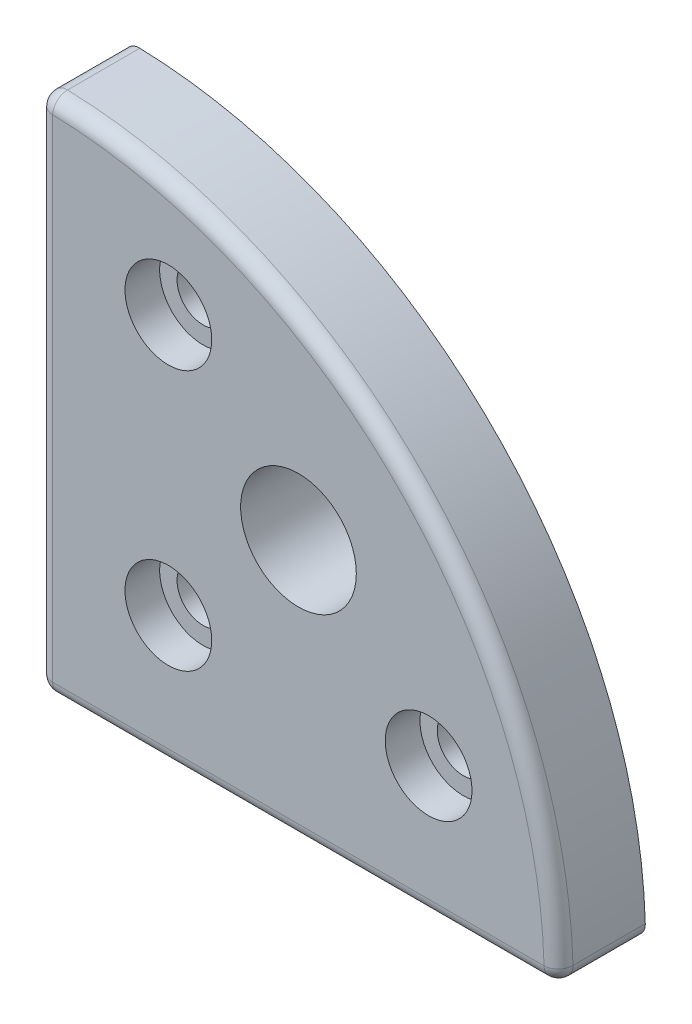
ISO-10303-21;
HEADER;
FILE_DESCRIPTION(('STEP AP214'),'2;1');
FILE_NAME('part.step','',(''),(''),'','','');
FILE_SCHEMA(('AUTOMOTIVE_DESIGN { 1 0 10303 214 1 1 1 1 }'));
ENDSEC;
DATA;
#1=APPLICATION_CONTEXT('core data for automotive mechanical design processes');
#2=APPLICATION_PROTOCOL_DEFINITION('international standard','automotive_design',2000,#1);
#3=PRODUCT_CONTEXT('',#1,'mechanical');
#4=PRODUCT('Part','Part','',(#3));
#5=PRODUCT_RELATED_PRODUCT_CATEGORY('part','',(#4));
#6=PRODUCT_DEFINITION_FORMATION('','',#4);
#7=PRODUCT_DEFINITION_CONTEXT('part definition',#1,'design');
#8=PRODUCT_DEFINITION('design','',#6,#7);
#9=PRODUCT_DEFINITION_SHAPE('','',#8);
#10=(LENGTH_UNIT() NAMED_UNIT(*) SI_UNIT(.MILLI.,.METRE.));
#11=(NAMED_UNIT(*) PLANE_ANGLE_UNIT() SI_UNIT($,.RADIAN.));
#12=(NAMED_UNIT(*) SI_UNIT($,.STERADIAN.) SOLID_ANGLE_UNIT());
#13=UNCERTAINTY_MEASURE_WITH_UNIT(LENGTH_MEASURE(1.E-05),#10,'distance_accuracy_value','');
#14=(GEOMETRIC_REPRESENTATION_CONTEXT(3) GLOBAL_UNCERTAINTY_ASSIGNED_CONTEXT((#13)) GLOBAL_UNIT_ASSIGNED_CONTEXT((#10,
#11,#12)) REPRESENTATION_CONTEXT('',''));
#15=CARTESIAN_POINT('',(0.,0.,0.));
#16=DIRECTION('',(0.,0.,1.));
#17=DIRECTION('',(1.,0.,0.));
#18=AXIS2_PLACEMENT_3D('',#15,#16,#17);
#19=CARTESIAN_POINT('',(65.9103992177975,51.8447142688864,9.));
#20=DIRECTION('',(0.,0.,1.));
#21=DIRECTION('',(1.,0.,0.));
#22=AXIS2_PLACEMENT_3D('',#19,#20,#21);
#23=CYLINDRICAL_SURFACE('',#22,7.5);
#24=CARTESIAN_POINT('',(65.9103992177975,51.8447142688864,9.));
#25=DIRECTION('',(0.,0.,1.));
#26=DIRECTION('',(1.,0.,0.));
#27=AXIS2_PLACEMENT_3D('',#24,#25,#26);
#28=CIRCLE('',#27,7.5);
#29=CARTESIAN_POINT('',(73.4103992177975,51.8447142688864,9.));
#30=VERTEX_POINT('',#29);
#31=EDGE_CURVE('E150',#30,#30,#28,.T.);
#32=ORIENTED_EDGE('',*,*,#31,.F.);
#33=EDGE_LOOP('',(#32));
#34=FACE_BOUND('',#33,.T.);
#35=CARTESIAN_POINT('',(65.9103992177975,51.8447142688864,15.));
#36=DIRECTION('',(0.,0.,1.));
#37=DIRECTION('',(1.,0.,0.));
#38=AXIS2_PLACEMENT_3D('',#35,#36,#37);
#39=CIRCLE('',#38,7.5);
#40=CARTESIAN_POINT('',(73.4103992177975,51.8447142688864,15.));
#41=VERTEX_POINT('',#40);
#42=EDGE_CURVE('E159',#41,#41,#39,.F.);
#43=ORIENTED_EDGE('',*,*,#42,.F.);
#44=EDGE_LOOP('',(#43));
#45=FACE_BOUND('',#44,.T.);
#46=ADVANCED_FACE('F15',(#34,#45),#23,.F.);
#47=CARTESIAN_POINT('',(20.9103992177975,51.8447142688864,9.));
#48=DIRECTION('',(0.,0.,1.));
#49=DIRECTION('',(1.,0.,0.));
#50=AXIS2_PLACEMENT_3D('',#47,#48,#49);
#51=CYLINDRICAL_SURFACE('',#50,7.5);
#52=CARTESIAN_POINT('',(20.9103992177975,51.8447142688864,9.));
#53=DIRECTION('',(0.,0.,1.));
#54=DIRECTION('',(1.,0.,0.));
#55=AXIS2_PLACEMENT_3D('',#52,#53,#54);
#56=CIRCLE('',#55,7.5);
#57=CARTESIAN_POINT('',(28.4103992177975,51.8447142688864,9.));
#58=VERTEX_POINT('',#57);
#59=EDGE_CURVE('E147',#58,#58,#56,.T.);
#60=ORIENTED_EDGE('',*,*,#59,.F.);
#61=EDGE_LOOP('',(#60));
#62=FACE_BOUND('',#61,.T.);
#63=CARTESIAN_POINT('',(20.9103992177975,51.8447142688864,15.));
#64=DIRECTION('',(0.,0.,1.));
#65=DIRECTION('',(1.,0.,0.));
#66=AXIS2_PLACEMENT_3D('',#63,#64,#65);
#67=CIRCLE('',#66,7.5);
#68=CARTESIAN_POINT('',(28.4103992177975,51.8447142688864,15.));
#69=VERTEX_POINT('',#68);
#70=EDGE_CURVE('E156',#69,#69,#67,.F.);
#71=ORIENTED_EDGE('',*,*,#70,.F.);
#72=EDGE_LOOP('',(#71));
#73=FACE_BOUND('',#72,.T.);
#74=ADVANCED_FACE('F432',(#62,#73),#51,.F.);
#75=CARTESIAN_POINT('',(20.9103992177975,96.8447142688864,9.));
#76=DIRECTION('',(0.,0.,1.));
#77=DIRECTION('',(1.,0.,0.));
#78=AXIS2_PLACEMENT_3D('',#75,#76,#77);
#79=CYLINDRICAL_SURFACE('',#78,7.5);
#80=CARTESIAN_POINT('',(20.9103992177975,96.8447142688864,9.));
#81=DIRECTION('',(0.,0.,1.));
#82=DIRECTION('',(1.,0.,0.));
#83=AXIS2_PLACEMENT_3D('',#80,#81,#82);
#84=CIRCLE('',#83,7.5);
#85=CARTESIAN_POINT('',(28.4103992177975,96.8447142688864,9.));
#86=VERTEX_POINT('',#85);
#87=EDGE_CURVE('E143',#86,#86,#84,.T.);
#88=ORIENTED_EDGE('',*,*,#87,.F.);
#89=EDGE_LOOP('',(#88));
#90=FACE_BOUND('',#89,.T.);
#91=CARTESIAN_POINT('',(20.9103992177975,96.8447142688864,15.));
#92=DIRECTION('',(0.,0.,1.));
#93=DIRECTION('',(1.,0.,0.));
#94=AXIS2_PLACEMENT_3D('',#91,#92,#93);
#95=CIRCLE('',#94,7.5);
#96=CARTESIAN_POINT('',(28.4103992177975,96.8447142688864,15.));
#97=VERTEX_POINT('',#96);
#98=EDGE_CURVE('E153',#97,#97,#95,.F.);
#99=ORIENTED_EDGE('',*,*,#98,.F.);
#100=EDGE_LOOP('',(#99));
#101=FACE_BOUND('',#100,.T.);
#102=ADVANCED_FACE('F426',(#90,#101),#79,.F.);
#103=CARTESIAN_POINT('',(0.910399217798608,49.292880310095,12.5));
#104=DIRECTION('',(0.,1.,0.));
#105=DIRECTION('',(-1.,0.,0.));
#106=AXIS2_PLACEMENT_3D('',#103,#104,#105);
#107=CYLINDRICAL_SURFACE('',#106,2.5);
#108=CARTESIAN_POINT('',(0.910399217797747,116.808992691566,12.5));
#109=DIRECTION('',(0.,1.,0.));
#110=DIRECTION('',(-1.,0.,0.));
#111=AXIS2_PLACEMENT_3D('',#108,#109,#110);
#112=CIRCLE('',#111,2.5);
#113=CARTESIAN_POINT('',(-1.58960078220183,116.808992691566,12.5));
#114=VERTEX_POINT('',#113);
#115=CARTESIAN_POINT('',(0.910399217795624,116.808992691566,15.));
#116=VERTEX_POINT('',#115);
#117=EDGE_CURVE('E71',#114,#116,#112,.T.);
#118=ORIENTED_EDGE('',*,*,#117,.F.);
#119=DIRECTION('',(0.,1.,0.));
#120=VECTOR('',#119,1.);
#121=CARTESIAN_POINT('',(-1.58960078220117,31.8447142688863,12.5));
#122=LINE('',#121,#120);
#123=CARTESIAN_POINT('',(-1.58960078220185,31.8447142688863,12.5));
#124=VERTEX_POINT('',#123);
#125=EDGE_CURVE('E146',#124,#114,#122,.T.);
#126=ORIENTED_EDGE('',*,*,#125,.F.);
#127=CARTESIAN_POINT('',(0.910399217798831,31.8447142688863,12.5));
#128=DIRECTION('',(0.,1.,0.));
#129=DIRECTION('',(-1.,0.,0.));
#130=AXIS2_PLACEMENT_3D('',#127,#128,#129);
#131=CIRCLE('',#130,2.5);
#132=CARTESIAN_POINT('',(0.910399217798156,31.8447142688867,15.));
#133=VERTEX_POINT('',#132);
#134=EDGE_CURVE('E18',#133,#124,#131,.F.);
#135=ORIENTED_EDGE('',*,*,#134,.F.);
#136=DIRECTION('',(0.,1.,0.));
#137=VECTOR('',#136,1.);
#138=CARTESIAN_POINT('',(0.910399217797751,66.741046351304,15.));
#139=LINE('',#138,#137);
#140=EDGE_CURVE('E162',#116,#133,#139,.F.);
#141=ORIENTED_EDGE('',*,*,#140,.F.);
#142=EDGE_LOOP('',(#118,#126,#135,#141));
#143=FACE_BOUND('',#142,.T.);
#144=ADVANCED_FACE('F186',(#143),#107,.T.);
#145=CARTESIAN_POINT('',(0.910399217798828,31.8447142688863,12.5));
#146=DIRECTION('',(-0.707106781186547,0.707106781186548,0.));
#147=DIRECTION('',(-0.707106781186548,-0.707106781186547,0.));
#148=AXIS2_PLACEMENT_3D('',#145,#146,#147);
#149=SPHERICAL_SURFACE('',#148,2.5);
#150=CARTESIAN_POINT('',(0.910399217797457,31.8447142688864,12.5));
#151=DIRECTION('',(0.,0.,1.));
#152=DIRECTION('',(1.,0.,0.));
#153=AXIS2_PLACEMENT_3D('',#150,#151,#152);
#154=CIRCLE('',#153,2.5);
#155=CARTESIAN_POINT('',(0.910399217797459,29.3447142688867,12.5));
#156=VERTEX_POINT('',#155);
#157=EDGE_CURVE('E183',#156,#124,#154,.F.);
#158=ORIENTED_EDGE('',*,*,#157,.F.);
#159=CARTESIAN_POINT('',(0.910399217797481,31.8447142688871,12.5));
#160=DIRECTION('',(-1.,0.,0.));
#161=DIRECTION('',(0.,-1.,0.));
#162=AXIS2_PLACEMENT_3D('',#159,#160,#161);
#163=CIRCLE('',#162,2.5);
#164=EDGE_CURVE('E177',#133,#156,#163,.F.);
#165=ORIENTED_EDGE('',*,*,#164,.F.);
#166=ORIENTED_EDGE('',*,*,#134,.T.);
#167=EDGE_LOOP('',(#158,#165,#166));
#168=FACE_BOUND('',#167,.T.);
#169=ADVANCED_FACE('F182',(#168),#149,.T.);
#170=CARTESIAN_POINT('',(60.8407044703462,31.8447142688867,12.5));
#171=DIRECTION('',(-1.,0.,0.));
#172=DIRECTION('',(0.,-1.,0.));
#173=AXIS2_PLACEMENT_3D('',#170,#171,#172);
#174=CYLINDRICAL_SURFACE('',#173,2.5);
#175=ORIENTED_EDGE('',*,*,#164,.T.);
#176=DIRECTION('',(1.,0.,0.));
#177=VECTOR('',#176,1.);
#178=CARTESIAN_POINT('',(85.8746776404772,29.3447142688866,12.5));
#179=LINE('',#178,#177);
#180=CARTESIAN_POINT('',(85.8746776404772,29.3447142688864,12.5));
#181=VERTEX_POINT('',#180);
#182=EDGE_CURVE('E97',#181,#156,#179,.F.);
#183=ORIENTED_EDGE('',*,*,#182,.F.);
#184=CARTESIAN_POINT('',(85.8746776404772,31.8447142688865,12.5));
#185=DIRECTION('',(-1.,0.,0.));
#186=DIRECTION('',(0.,-1.,0.));
#187=AXIS2_PLACEMENT_3D('',#184,#185,#186);
#188=CIRCLE('',#187,2.5);
#189=CARTESIAN_POINT('',(85.8746776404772,31.8447142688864,15.));
#190=VERTEX_POINT('',#189);
#191=EDGE_CURVE('E173',#190,#181,#188,.F.);
#192=ORIENTED_EDGE('',*,*,#191,.F.);
#193=DIRECTION('',(1.,0.,0.));
#194=VECTOR('',#193,1.);
#195=CARTESIAN_POINT('',(35.8067313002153,31.8447142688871,15.));
#196=LINE('',#195,#194);
#197=EDGE_CURVE('E164',#133,#190,#196,.T.);
#198=ORIENTED_EDGE('',*,*,#197,.F.);
#199=EDGE_LOOP('',(#175,#183,#192,#198));
#200=FACE_BOUND('',#199,.T.);
#201=ADVANCED_FACE('F240',(#200),#174,.T.);
#202=CARTESIAN_POINT('',(85.8746776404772,31.8447142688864,12.5));
#203=DIRECTION('',(-0.707106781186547,0.707106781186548,0.));
#204=DIRECTION('',(-0.707106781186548,-0.707106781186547,0.));
#205=AXIS2_PLACEMENT_3D('',#202,#203,#204);
#206=SPHERICAL_SURFACE('',#205,2.5);
#207=CARTESIAN_POINT('',(85.8746776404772,31.8447142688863,12.5));
#208=DIRECTION('',(0.,0.,1.));
#209=DIRECTION('',(1.,0.,0.));
#210=AXIS2_PLACEMENT_3D('',#207,#208,#209);
#211=CIRCLE('',#210,2.5);
#212=CARTESIAN_POINT('',(88.3736570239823,31.916142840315,12.5));
#213=VERTEX_POINT('',#212);
#214=CARTESIAN_POINT('',(87.6424445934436,30.07694731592,12.5));
#215=VERTEX_POINT('',#214);
#216=EDGE_CURVE('E33',#213,#215,#211,.F.);
#217=ORIENTED_EDGE('',*,*,#216,.F.);
#218=CARTESIAN_POINT('',(85.8746776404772,31.8447142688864,12.5));
#219=DIRECTION('',(0.0285714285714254,-0.999591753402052,0.));
#220=DIRECTION('',(0.999591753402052,0.0285714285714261,0.));
#221=AXIS2_PLACEMENT_3D('',#218,#219,#220);
#222=CIRCLE('',#221,2.5);
#223=EDGE_CURVE('E169',#190,#213,#222,.F.);
#224=ORIENTED_EDGE('',*,*,#223,.F.);
#225=ORIENTED_EDGE('',*,*,#191,.T.);
#226=CARTESIAN_POINT('',(85.8746776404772,31.8447142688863,12.5));
#227=DIRECTION('',(0.,0.,1.));
#228=DIRECTION('',(1.,0.,0.));
#229=AXIS2_PLACEMENT_3D('',#226,#227,#228);
#230=CIRCLE('',#229,2.5);
#231=EDGE_CURVE('E140',#215,#181,#230,.F.);
#232=ORIENTED_EDGE('',*,*,#231,.F.);
#233=EDGE_LOOP('',(#217,#224,#225,#232));
#234=FACE_BOUND('',#233,.T.);
#235=ADVANCED_FACE('F237',(#234),#206,.T.);
#236=CARTESIAN_POINT('',(-1.58960078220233,29.3447142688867,12.5));
#237=DIRECTION('',(0.,0.,-1.));
#238=DIRECTION('',(0.707106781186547,-0.707106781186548,0.));
#239=AXIS2_PLACEMENT_3D('',#236,#237,#238);
#240=TOROIDAL_SURFACE('',#239,87.5,2.5);
#241=ORIENTED_EDGE('',*,*,#223,.T.);
#242=CARTESIAN_POINT('',(-1.58960078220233,29.3447142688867,12.5));
#243=DIRECTION('',(0.,0.,1.));
#244=DIRECTION('',(1.,0.,0.));
#245=AXIS2_PLACEMENT_3D('',#242,#243,#244);
#246=CIRCLE('',#245,90.);
#247=CARTESIAN_POINT('',(0.981827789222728,119.307972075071,12.5));
#248=VERTEX_POINT('',#247);
#249=EDGE_CURVE('E231',#248,#213,#246,.F.);
#250=ORIENTED_EDGE('',*,*,#249,.F.);
#251=CARTESIAN_POINT('',(0.910399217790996,116.808992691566,12.5));
#252=DIRECTION('',(0.999591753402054,-0.0285714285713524,0.));
#253=DIRECTION('',(0.0285714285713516,0.999591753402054,0.));
#254=AXIS2_PLACEMENT_3D('',#251,#252,#253);
#255=CIRCLE('',#254,2.5);
#256=EDGE_CURVE('E165',#116,#248,#255,.F.);
#257=ORIENTED_EDGE('',*,*,#256,.F.);
#258=CARTESIAN_POINT('',(-1.58960078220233,29.3447142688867,15.));
#259=DIRECTION('',(0.,0.,-1.));
#260=DIRECTION('',(0.0285714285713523,0.999591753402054,0.));
#261=AXIS2_PLACEMENT_3D('',#258,#259,#260);
#262=CIRCLE('',#261,87.4999999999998);
#263=EDGE_CURVE('E200',#190,#116,#262,.F.);
#264=ORIENTED_EDGE('',*,*,#263,.F.);
#265=EDGE_LOOP('',(#241,#250,#257,#264));
#266=FACE_BOUND('',#265,.T.);
#267=ADVANCED_FACE('F224',(#266),#240,.T.);
#268=CARTESIAN_POINT('',(0.910399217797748,116.808992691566,12.5));
#269=DIRECTION('',(-0.707106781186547,0.707106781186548,0.));
#270=DIRECTION('',(-0.707106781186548,-0.707106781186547,0.));
#271=AXIS2_PLACEMENT_3D('',#268,#269,#270);
#272=SPHERICAL_SURFACE('',#271,2.5);
#273=CARTESIAN_POINT('',(0.910399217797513,116.808992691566,12.5));
#274=DIRECTION('',(0.,0.,1.));
#275=DIRECTION('',(1.,0.,0.));
#276=AXIS2_PLACEMENT_3D('',#273,#274,#275);
#277=CIRCLE('',#276,2.5);
#278=CARTESIAN_POINT('',(-0.857367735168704,118.576759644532,12.5));
#279=VERTEX_POINT('',#278);
#280=EDGE_CURVE('E139',#114,#279,#277,.F.);
#281=ORIENTED_EDGE('',*,*,#280,.F.);
#282=ORIENTED_EDGE('',*,*,#117,.T.);
#283=ORIENTED_EDGE('',*,*,#256,.T.);
#284=CARTESIAN_POINT('',(0.910399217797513,116.808992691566,12.5));
#285=DIRECTION('',(0.,0.,1.));
#286=DIRECTION('',(1.,0.,0.));
#287=AXIS2_PLACEMENT_3D('',#284,#285,#286);
#288=CIRCLE('',#287,2.5);
#289=EDGE_CURVE('E135',#279,#248,#288,.F.);
#290=ORIENTED_EDGE('',*,*,#289,.F.);
#291=EDGE_LOOP('',(#281,#282,#283,#290));
#292=FACE_BOUND('',#291,.T.);
#293=ADVANCED_FACE('F218',(#292),#272,.T.);
#294=CARTESIAN_POINT('',(35.8067313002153,66.741046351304,15.));
#295=DIRECTION('',(0.,0.,1.));
#296=DIRECTION('',(1.,0.,0.));
#297=AXIS2_PLACEMENT_3D('',#294,#295,#296);
#298=PLANE('',#297);
#299=ORIENTED_EDGE('',*,*,#98,.T.);
#300=EDGE_LOOP('',(#299));
#301=FACE_BOUND('',#300,.T.);
#302=ORIENTED_EDGE('',*,*,#70,.T.);
#303=EDGE_LOOP('',(#302));
#304=FACE_BOUND('',#303,.T.);
#305=ORIENTED_EDGE('',*,*,#42,.T.);
#306=EDGE_LOOP('',(#305));
#307=FACE_BOUND('',#306,.T.);
#308=CARTESIAN_POINT('',(43.4103992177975,74.3447142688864,15.));
#309=DIRECTION('',(0.,0.,1.));
#310=DIRECTION('',(1.,0.,0.));
#311=AXIS2_PLACEMENT_3D('',#308,#309,#310);
#312=CIRCLE('',#311,10.);
#313=CARTESIAN_POINT('',(53.4103992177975,74.3447142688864,15.));
#314=VERTEX_POINT('',#313);
#315=EDGE_CURVE('E131',#314,#314,#312,.F.);
#316=ORIENTED_EDGE('',*,*,#315,.T.);
#317=EDGE_LOOP('',(#316));
#318=FACE_BOUND('',#317,.T.);
#319=ORIENTED_EDGE('',*,*,#263,.T.);
#320=ORIENTED_EDGE('',*,*,#140,.T.);
#321=ORIENTED_EDGE('',*,*,#197,.T.);
#322=EDGE_LOOP('',(#319,#320,#321));
#323=FACE_BOUND('',#322,.T.);
#324=ADVANCED_FACE('F207',(#301,#304,#307,#318,#323),#298,.T.);
#325=CARTESIAN_POINT('',(65.9103992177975,51.8447142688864,9.));
#326=DIRECTION('',(0.,0.,1.));
#327=DIRECTION('',(1.,0.,0.));
#328=AXIS2_PLACEMENT_3D('',#325,#326,#327);
#329=PLANE('',#328);
#330=CARTESIAN_POINT('',(65.9103992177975,51.8447142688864,9.));
#331=DIRECTION('',(0.,0.,1.));
#332=DIRECTION('',(1.,0.,0.));
#333=AXIS2_PLACEMENT_3D('',#330,#331,#332);
#334=CIRCLE('',#333,4.5);
#335=CARTESIAN_POINT('',(70.4103992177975,51.8447142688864,9.));
#336=VERTEX_POINT('',#335);
#337=EDGE_CURVE('E128',#336,#336,#334,.F.);
#338=ORIENTED_EDGE('',*,*,#337,.T.);
#339=EDGE_LOOP('',(#338));
#340=FACE_BOUND('',#339,.T.);
#341=ORIENTED_EDGE('',*,*,#31,.T.);
#342=EDGE_LOOP('',(#341));
#343=FACE_BOUND('',#342,.T.);
#344=ADVANCED_FACE('F217',(#340,#343),#329,.T.);
#345=CARTESIAN_POINT('',(20.9103992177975,51.8447142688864,9.));
#346=DIRECTION('',(0.,0.,1.));
#347=DIRECTION('',(1.,0.,0.));
#348=AXIS2_PLACEMENT_3D('',#345,#346,#347);
#349=PLANE('',#348);
#350=CARTESIAN_POINT('',(20.9103992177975,51.8447142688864,9.));
#351=DIRECTION('',(0.,0.,1.));
#352=DIRECTION('',(1.,0.,0.));
#353=AXIS2_PLACEMENT_3D('',#350,#351,#352);
#354=CIRCLE('',#353,4.5);
#355=CARTESIAN_POINT('',(25.4103992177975,51.8447142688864,9.));
#356=VERTEX_POINT('',#355);
#357=EDGE_CURVE('E125',#356,#356,#354,.F.);
#358=ORIENTED_EDGE('',*,*,#357,.T.);
#359=EDGE_LOOP('',(#358));
#360=FACE_BOUND('',#359,.T.);
#361=ORIENTED_EDGE('',*,*,#59,.T.);
#362=EDGE_LOOP('',(#361));
#363=FACE_BOUND('',#362,.T.);
#364=ADVANCED_FACE('F381',(#360,#363),#349,.T.);
#365=CARTESIAN_POINT('',(20.9103992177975,96.8447142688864,9.));
#366=DIRECTION('',(0.,0.,1.));
#367=DIRECTION('',(1.,0.,0.));
#368=AXIS2_PLACEMENT_3D('',#365,#366,#367);
#369=PLANE('',#368);
#370=CARTESIAN_POINT('',(20.9103992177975,96.8447142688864,9.));
#371=DIRECTION('',(0.,0.,1.));
#372=DIRECTION('',(1.,0.,0.));
#373=AXIS2_PLACEMENT_3D('',#370,#371,#372);
#374=CIRCLE('',#373,4.5);
#375=CARTESIAN_POINT('',(25.4103992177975,96.8447142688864,9.));
#376=VERTEX_POINT('',#375);
#377=EDGE_CURVE('E118',#376,#376,#374,.F.);
#378=ORIENTED_EDGE('',*,*,#377,.T.);
#379=EDGE_LOOP('',(#378));
#380=FACE_BOUND('',#379,.T.);
#381=ORIENTED_EDGE('',*,*,#87,.T.);
#382=EDGE_LOOP('',(#381));
#383=FACE_BOUND('',#382,.T.);
#384=ADVANCED_FACE('F374',(#380,#383),#369,.T.);
#385=CARTESIAN_POINT('',(-1.58960078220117,31.8447142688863,0.));
#386=DIRECTION('',(-1.,0.,0.));
#387=DIRECTION('',(0.,0.,1.));
#388=AXIS2_PLACEMENT_3D('',#385,#386,#387);
#389=PLANE('',#388);
#390=DIRECTION('',(0.,1.,0.));
#391=VECTOR('',#390,1.);
#392=CARTESIAN_POINT('',(-1.58960078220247,66.741046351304,0.));
#393=LINE('',#392,#391);
#394=CARTESIAN_POINT('',(-1.58960078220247,116.808992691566,0.));
#395=VERTEX_POINT('',#394);
#396=CARTESIAN_POINT('',(-1.5896007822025,31.8447142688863,0.));
#397=VERTEX_POINT('',#396);
#398=EDGE_CURVE('E116',#395,#397,#393,.F.);
#399=ORIENTED_EDGE('',*,*,#398,.T.);
#400=DIRECTION('',(0.,0.,1.));
#401=VECTOR('',#400,1.);
#402=CARTESIAN_POINT('',(-1.58960078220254,31.8447142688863,0.));
#403=LINE('',#402,#401);
#404=EDGE_CURVE('E115',#124,#397,#403,.F.);
#405=ORIENTED_EDGE('',*,*,#404,.F.);
#406=ORIENTED_EDGE('',*,*,#125,.T.);
#407=DIRECTION('',(0.,0.,1.));
#408=VECTOR('',#407,1.);
#409=CARTESIAN_POINT('',(-1.58960078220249,116.808992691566,0.));
#410=LINE('',#409,#408);
#411=EDGE_CURVE('E134',#395,#114,#410,.T.);
#412=ORIENTED_EDGE('',*,*,#411,.F.);
#413=EDGE_LOOP('',(#399,#405,#406,#412));
#414=FACE_BOUND('',#413,.T.);
#415=ADVANCED_FACE('F190',(#414),#389,.T.);
#416=CARTESIAN_POINT('',(0.910399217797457,31.8447142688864,0.));
#417=DIRECTION('',(0.,0.,1.));
#418=DIRECTION('',(1.,0.,0.));
#419=AXIS2_PLACEMENT_3D('',#416,#417,#418);
#420=CYLINDRICAL_SURFACE('',#419,2.5);
#421=CARTESIAN_POINT('',(0.910399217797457,31.8447142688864,0.));
#422=DIRECTION('',(0.,0.,1.));
#423=DIRECTION('',(1.,0.,0.));
#424=AXIS2_PLACEMENT_3D('',#421,#422,#423);
#425=CIRCLE('',#424,2.5);
#426=CARTESIAN_POINT('',(0.910399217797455,29.3447142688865,0.));
#427=VERTEX_POINT('',#426);
#428=EDGE_CURVE('E108',#397,#427,#425,.T.);
#429=ORIENTED_EDGE('',*,*,#428,.T.);
#430=DIRECTION('',(0.,0.,-1.));
#431=VECTOR('',#430,1.);
#432=CARTESIAN_POINT('',(0.910399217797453,29.3447142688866,0.));
#433=LINE('',#432,#431);
#434=EDGE_CURVE('E91',#156,#427,#433,.T.);
#435=ORIENTED_EDGE('',*,*,#434,.F.);
#436=ORIENTED_EDGE('',*,*,#157,.T.);
#437=ORIENTED_EDGE('',*,*,#404,.T.);
#438=EDGE_LOOP('',(#429,#435,#436,#437));
#439=FACE_BOUND('',#438,.T.);
#440=ADVANCED_FACE('F113',(#439),#420,.T.);
#441=CARTESIAN_POINT('',(85.8746776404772,29.3447142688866,0.));
#442=DIRECTION('',(0.,-1.,0.));
#443=DIRECTION('',(0.,0.,-1.));
#444=AXIS2_PLACEMENT_3D('',#441,#442,#443);
#445=PLANE('',#444);
#446=DIRECTION('',(1.,0.,0.));
#447=VECTOR('',#446,1.);
#448=CARTESIAN_POINT('',(35.8067313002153,29.3447142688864,0.));
#449=LINE('',#448,#447);
#450=CARTESIAN_POINT('',(85.8746776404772,29.3447142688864,0.));
#451=VERTEX_POINT('',#450);
#452=EDGE_CURVE('E95',#427,#451,#449,.T.);
#453=ORIENTED_EDGE('',*,*,#452,.T.);
#454=DIRECTION('',(0.,0.,1.));
#455=VECTOR('',#454,1.);
#456=CARTESIAN_POINT('',(85.8746776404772,29.3447142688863,0.));
#457=LINE('',#456,#455);
#458=EDGE_CURVE('E142',#181,#451,#457,.F.);
#459=ORIENTED_EDGE('',*,*,#458,.F.);
#460=ORIENTED_EDGE('',*,*,#182,.T.);
#461=ORIENTED_EDGE('',*,*,#434,.T.);
#462=EDGE_LOOP('',(#453,#459,#460,#461));
#463=FACE_BOUND('',#462,.T.);
#464=ADVANCED_FACE('F93',(#463),#445,.T.);
#465=CARTESIAN_POINT('',(85.8746776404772,31.8447142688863,0.));
#466=DIRECTION('',(0.,0.,1.));
#467=DIRECTION('',(1.,0.,0.));
#468=AXIS2_PLACEMENT_3D('',#465,#466,#467);
#469=CYLINDRICAL_SURFACE('',#468,2.5);
#470=CARTESIAN_POINT('',(85.8746776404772,31.8447142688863,0.));
#471=DIRECTION('',(0.,0.,1.));
#472=DIRECTION('',(1.,0.,0.));
#473=AXIS2_PLACEMENT_3D('',#470,#471,#472);
#474=CIRCLE('',#473,2.5);
#475=CARTESIAN_POINT('',(88.3736570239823,31.916142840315,0.));
#476=VERTEX_POINT('',#475);
#477=EDGE_CURVE('E111',#451,#476,#474,.T.);
#478=ORIENTED_EDGE('',*,*,#477,.T.);
#479=DIRECTION('',(0.,0.,1.));
#480=VECTOR('',#479,1.);
#481=CARTESIAN_POINT('',(88.3736570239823,31.916142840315,0.));
#482=LINE('',#481,#480);
#483=EDGE_CURVE('E274',#213,#476,#482,.F.);
#484=ORIENTED_EDGE('',*,*,#483,.F.);
#485=ORIENTED_EDGE('',*,*,#216,.T.);
#486=ORIENTED_EDGE('',*,*,#231,.T.);
#487=ORIENTED_EDGE('',*,*,#458,.T.);
#488=EDGE_LOOP('',(#478,#484,#485,#486,#487));
#489=FACE_BOUND('',#488,.T.);
#490=ADVANCED_FACE('F273',(#489),#469,.T.);
#491=CARTESIAN_POINT('',(-1.58960078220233,29.3447142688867,0.));
#492=DIRECTION('',(0.,0.,1.));
#493=DIRECTION('',(1.,0.,0.));
#494=AXIS2_PLACEMENT_3D('',#491,#492,#493);
#495=CYLINDRICAL_SURFACE('',#494,90.);
#496=CARTESIAN_POINT('',(-1.58960078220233,29.3447142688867,0.));
#497=DIRECTION('',(0.,0.,1.));
#498=DIRECTION('',(1.,0.,0.));
#499=AXIS2_PLACEMENT_3D('',#496,#497,#498);
#500=CIRCLE('',#499,90.);
#501=CARTESIAN_POINT('',(0.981827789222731,119.307972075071,0.));
#502=VERTEX_POINT('',#501);
#503=EDGE_CURVE('E269',#476,#502,#500,.T.);
#504=ORIENTED_EDGE('',*,*,#503,.T.);
#505=DIRECTION('',(0.,0.,1.));
#506=VECTOR('',#505,1.);
#507=CARTESIAN_POINT('',(0.981827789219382,119.307972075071,0.));
#508=LINE('',#507,#506);
#509=EDGE_CURVE('E138',#248,#502,#508,.F.);
#510=ORIENTED_EDGE('',*,*,#509,.F.);
#511=ORIENTED_EDGE('',*,*,#249,.T.);
#512=ORIENTED_EDGE('',*,*,#483,.T.);
#513=EDGE_LOOP('',(#504,#510,#511,#512));
#514=FACE_BOUND('',#513,.T.);
#515=ADVANCED_FACE('F286',(#514),#495,.T.);
#516=CARTESIAN_POINT('',(0.910399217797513,116.808992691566,0.));
#517=DIRECTION('',(0.,0.,1.));
#518=DIRECTION('',(1.,0.,0.));
#519=AXIS2_PLACEMENT_3D('',#516,#517,#518);
#520=CYLINDRICAL_SURFACE('',#519,2.5);
#521=CARTESIAN_POINT('',(0.910399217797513,116.808992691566,0.));
#522=DIRECTION('',(0.,0.,1.));
#523=DIRECTION('',(1.,0.,0.));
#524=AXIS2_PLACEMENT_3D('',#521,#522,#523);
#525=CIRCLE('',#524,2.5);
#526=EDGE_CURVE('E267',#502,#395,#525,.T.);
#527=ORIENTED_EDGE('',*,*,#526,.T.);
#528=ORIENTED_EDGE('',*,*,#411,.T.);
#529=ORIENTED_EDGE('',*,*,#280,.T.);
#530=ORIENTED_EDGE('',*,*,#289,.T.);
#531=ORIENTED_EDGE('',*,*,#509,.T.);
#532=EDGE_LOOP('',(#527,#528,#529,#530,#531));
#533=FACE_BOUND('',#532,.T.);
#534=ADVANCED_FACE('F282',(#533),#520,.T.);
#535=CARTESIAN_POINT('',(43.4103992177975,74.3447142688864,0.));
#536=DIRECTION('',(0.,0.,1.));
#537=DIRECTION('',(1.,0.,0.));
#538=AXIS2_PLACEMENT_3D('',#535,#536,#537);
#539=CYLINDRICAL_SURFACE('',#538,10.);
#540=CARTESIAN_POINT('',(43.4103992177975,74.3447142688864,0.));
#541=DIRECTION('',(0.,0.,1.));
#542=DIRECTION('',(1.,0.,0.));
#543=AXIS2_PLACEMENT_3D('',#540,#541,#542);
#544=CIRCLE('',#543,10.);
#545=CARTESIAN_POINT('',(53.4103992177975,74.3447142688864,0.));
#546=VERTEX_POINT('',#545);
#547=EDGE_CURVE('E264',#546,#546,#544,.F.);
#548=ORIENTED_EDGE('',*,*,#547,.T.);
#549=EDGE_LOOP('',(#548));
#550=FACE_BOUND('',#549,.T.);
#551=ORIENTED_EDGE('',*,*,#315,.F.);
#552=EDGE_LOOP('',(#551));
#553=FACE_BOUND('',#552,.T.);
#554=ADVANCED_FACE('F294',(#550,#553),#539,.F.);
#555=CARTESIAN_POINT('',(65.9103992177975,51.8447142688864,0.));
#556=DIRECTION('',(0.,0.,1.));
#557=DIRECTION('',(1.,0.,0.));
#558=AXIS2_PLACEMENT_3D('',#555,#556,#557);
#559=CYLINDRICAL_SURFACE('',#558,4.5);
#560=CARTESIAN_POINT('',(65.9103992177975,51.8447142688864,0.));
#561=DIRECTION('',(0.,0.,1.));
#562=DIRECTION('',(1.,0.,0.));
#563=AXIS2_PLACEMENT_3D('',#560,#561,#562);
#564=CIRCLE('',#563,4.5);
#565=CARTESIAN_POINT('',(70.4103992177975,51.8447142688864,0.));
#566=VERTEX_POINT('',#565);
#567=EDGE_CURVE('E261',#566,#566,#564,.F.);
#568=ORIENTED_EDGE('',*,*,#567,.T.);
#569=EDGE_LOOP('',(#568));
#570=FACE_BOUND('',#569,.T.);
#571=ORIENTED_EDGE('',*,*,#337,.F.);
#572=EDGE_LOOP('',(#571));
#573=FACE_BOUND('',#572,.T.);
#574=ADVANCED_FACE('F312',(#570,#573),#559,.F.);
#575=CARTESIAN_POINT('',(20.9103992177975,51.8447142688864,0.));
#576=DIRECTION('',(0.,0.,1.));
#577=DIRECTION('',(1.,0.,0.));
#578=AXIS2_PLACEMENT_3D('',#575,#576,#577);
#579=CYLINDRICAL_SURFACE('',#578,4.5);
#580=CARTESIAN_POINT('',(20.9103992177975,51.8447142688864,0.));
#581=DIRECTION('',(0.,0.,1.));
#582=DIRECTION('',(1.,0.,0.));
#583=AXIS2_PLACEMENT_3D('',#580,#581,#582);
#584=CIRCLE('',#583,4.5);
#585=CARTESIAN_POINT('',(25.4103992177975,51.8447142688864,0.));
#586=VERTEX_POINT('',#585);
#587=EDGE_CURVE('E24',#586,#586,#584,.F.);
#588=ORIENTED_EDGE('',*,*,#587,.T.);
#589=EDGE_LOOP('',(#588));
#590=FACE_BOUND('',#589,.T.);
#591=ORIENTED_EDGE('',*,*,#357,.F.);
#592=EDGE_LOOP('',(#591));
#593=FACE_BOUND('',#592,.T.);
#594=ADVANCED_FACE('F304',(#590,#593),#579,.F.);
#595=CARTESIAN_POINT('',(20.9103992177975,96.8447142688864,0.));
#596=DIRECTION('',(0.,0.,1.));
#597=DIRECTION('',(1.,0.,0.));
#598=AXIS2_PLACEMENT_3D('',#595,#596,#597);
#599=CYLINDRICAL_SURFACE('',#598,4.5);
#600=CARTESIAN_POINT('',(20.9103992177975,96.8447142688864,0.));
#601=DIRECTION('',(0.,0.,1.));
#602=DIRECTION('',(1.,0.,0.));
#603=AXIS2_PLACEMENT_3D('',#600,#601,#602);
#604=CIRCLE('',#603,4.5);
#605=CARTESIAN_POINT('',(25.4103992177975,96.8447142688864,0.));
#606=VERTEX_POINT('',#605);
#607=EDGE_CURVE('E10',#606,#606,#604,.F.);
#608=ORIENTED_EDGE('',*,*,#607,.T.);
#609=EDGE_LOOP('',(#608));
#610=FACE_BOUND('',#609,.T.);
#611=ORIENTED_EDGE('',*,*,#377,.F.);
#612=EDGE_LOOP('',(#611));
#613=FACE_BOUND('',#612,.T.);
#614=ADVANCED_FACE('F298',(#610,#613),#599,.F.);
#615=CARTESIAN_POINT('',(35.8067313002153,66.741046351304,0.));
#616=DIRECTION('',(0.,0.,1.));
#617=DIRECTION('',(1.,0.,0.));
#618=AXIS2_PLACEMENT_3D('',#615,#616,#617);
#619=PLANE('',#618);
#620=ORIENTED_EDGE('',*,*,#607,.F.);
#621=EDGE_LOOP('',(#620));
#622=FACE_BOUND('',#621,.T.);
#623=ORIENTED_EDGE('',*,*,#587,.F.);
#624=EDGE_LOOP('',(#623));
#625=FACE_BOUND('',#624,.T.);
#626=ORIENTED_EDGE('',*,*,#567,.F.);
#627=EDGE_LOOP('',(#626));
#628=FACE_BOUND('',#627,.T.);
#629=ORIENTED_EDGE('',*,*,#547,.F.);
#630=EDGE_LOOP('',(#629));
#631=FACE_BOUND('',#630,.T.);
#632=ORIENTED_EDGE('',*,*,#503,.F.);
#633=ORIENTED_EDGE('',*,*,#477,.F.);
#634=ORIENTED_EDGE('',*,*,#452,.F.);
#635=ORIENTED_EDGE('',*,*,#428,.F.);
#636=ORIENTED_EDGE('',*,*,#398,.F.);
#637=ORIENTED_EDGE('',*,*,#526,.F.);
#638=EDGE_LOOP('',(#632,#633,#634,#635,#636,#637));
#639=FACE_BOUND('',#638,.T.);
#640=ADVANCED_FACE('F107',(#622,#625,#628,#631,#639),#619,.F.);
#641=CLOSED_SHELL('',(#46,#74,#102,#144,#169,#201,#235,#267,#293,#324,#344,#364,#384,#415,#440,
#464,#490,#515,#534,#554,#574,#594,#614,#640));
#642=MANIFOLD_SOLID_BREP('B1',#641);
#643=ADVANCED_BREP_SHAPE_REPRESENTATION('',(#18,#642),#14);
#644=SHAPE_DEFINITION_REPRESENTATION(#9,#643);
ENDSEC;
END-ISO-10303-21;
